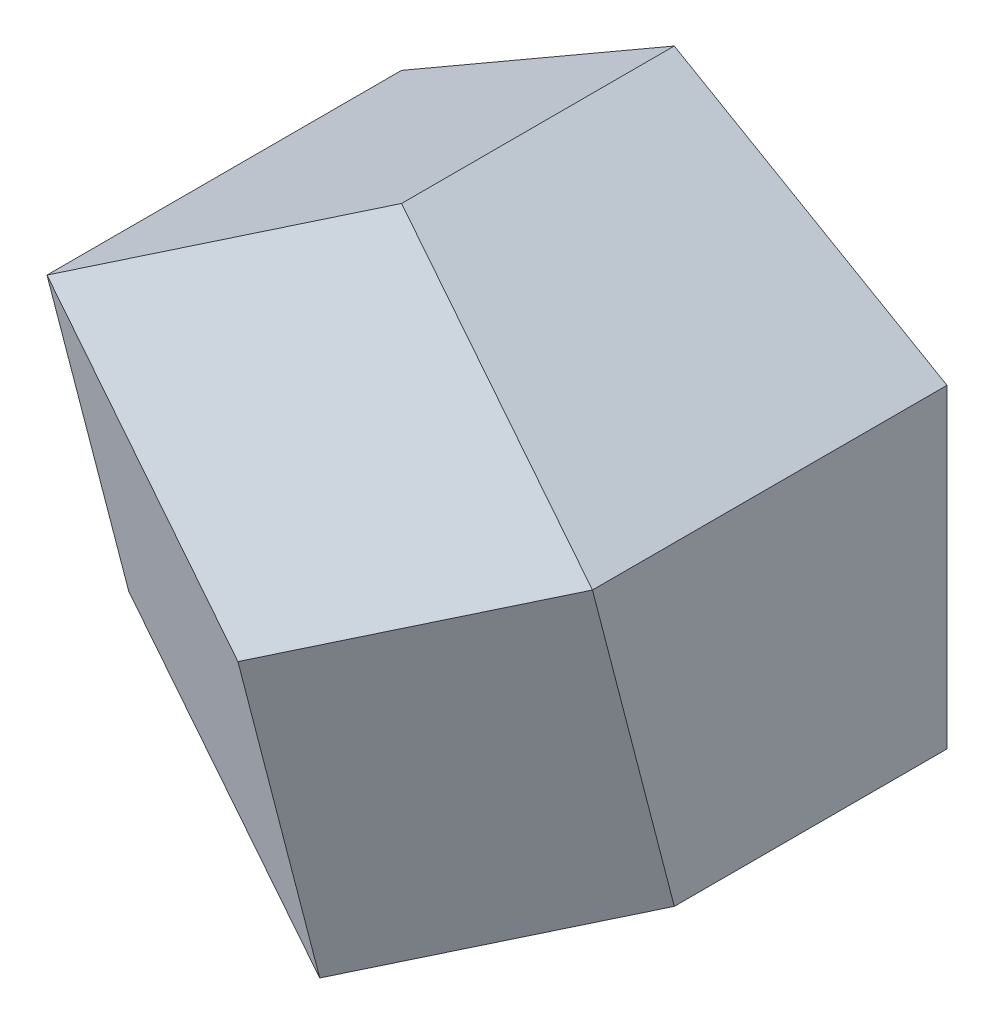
ISO-10303-21;
HEADER;
FILE_DESCRIPTION(('STEP AP214'),'2;1');
FILE_NAME('part.step','',(''),(''),'','','');
FILE_SCHEMA(('AUTOMOTIVE_DESIGN { 1 0 10303 214 1 1 1 1 }'));
ENDSEC;
DATA;
#1=APPLICATION_CONTEXT('core data for automotive mechanical design processes');
#2=APPLICATION_PROTOCOL_DEFINITION('international standard','automotive_design',2000,#1);
#3=PRODUCT_CONTEXT('',#1,'mechanical');
#4=PRODUCT('Part','Part','',(#3));
#5=PRODUCT_RELATED_PRODUCT_CATEGORY('part','',(#4));
#6=PRODUCT_DEFINITION_FORMATION('','',#4);
#7=PRODUCT_DEFINITION_CONTEXT('part definition',#1,'design');
#8=PRODUCT_DEFINITION('design','',#6,#7);
#9=PRODUCT_DEFINITION_SHAPE('','',#8);
#10=(LENGTH_UNIT() NAMED_UNIT(*) SI_UNIT(.MILLI.,.METRE.));
#11=(NAMED_UNIT(*) PLANE_ANGLE_UNIT() SI_UNIT($,.RADIAN.));
#12=(NAMED_UNIT(*) SI_UNIT($,.STERADIAN.) SOLID_ANGLE_UNIT());
#13=UNCERTAINTY_MEASURE_WITH_UNIT(LENGTH_MEASURE(1.E-05),#10,'distance_accuracy_value','');
#14=(GEOMETRIC_REPRESENTATION_CONTEXT(3) GLOBAL_UNCERTAINTY_ASSIGNED_CONTEXT((#13)) GLOBAL_UNIT_ASSIGNED_CONTEXT((#10,
#11,#12)) REPRESENTATION_CONTEXT('',''));
#15=CARTESIAN_POINT('',(0.,0.,0.));
#16=DIRECTION('',(0.,0.,1.));
#17=DIRECTION('',(1.,0.,0.));
#18=AXIS2_PLACEMENT_3D('',#15,#16,#17);
#19=CARTESIAN_POINT('',(50.,28.8675134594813,-50.));
#20=DIRECTION('',(0.5,0.866025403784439,0.));
#21=DIRECTION('',(-0.866025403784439,0.5,0.));
#22=AXIS2_PLACEMENT_3D('',#19,#20,#21);
#23=PLANE('',#22);
#24=DIRECTION('',(-0.838198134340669,0.483933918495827,-0.251459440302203));
#25=VECTOR('',#24,1.);
#26=CARTESIAN_POINT('',(36.2997658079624,36.7773473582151,10.8899297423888));
#27=LINE('',#26,#25);
#28=CARTESIAN_POINT('',(50.,28.8675134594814,15.0000000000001));
#29=VERTEX_POINT('',#28);
#30=CARTESIAN_POINT('',(0.,57.7350269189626,0.));
#31=VERTEX_POINT('',#30);
#32=EDGE_CURVE('E109',#29,#31,#27,.T.);
#33=ORIENTED_EDGE('',*,*,#32,.F.);
#34=DIRECTION('',(0.,0.,1.));
#35=VECTOR('',#34,1.);
#36=CARTESIAN_POINT('',(50.,28.8675134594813,-50.));
#37=LINE('',#36,#35);
#38=CARTESIAN_POINT('',(50.,28.8675134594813,-50.));
#39=VERTEX_POINT('',#38);
#40=EDGE_CURVE('E125',#39,#29,#37,.T.);
#41=ORIENTED_EDGE('',*,*,#40,.F.);
#42=DIRECTION('',(-0.866025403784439,0.5,0.));
#43=VECTOR('',#42,1.);
#44=CARTESIAN_POINT('',(50.,28.8675134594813,-50.));
#45=LINE('',#44,#43);
#46=CARTESIAN_POINT('',(0.,57.7350269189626,-50.));
#47=VERTEX_POINT('',#46);
#48=EDGE_CURVE('E155',#39,#47,#45,.T.);
#49=ORIENTED_EDGE('',*,*,#48,.T.);
#50=DIRECTION('',(0.,0.,1.));
#51=VECTOR('',#50,1.);
#52=CARTESIAN_POINT('',(0.,57.7350269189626,-50.));
#53=LINE('',#52,#51);
#54=EDGE_CURVE('E118',#47,#31,#53,.T.);
#55=ORIENTED_EDGE('',*,*,#54,.T.);
#56=EDGE_LOOP('',(#33,#41,#49,#55));
#57=FACE_BOUND('',#56,.T.);
#58=ADVANCED_FACE('F36',(#57),#23,.T.);
#59=CARTESIAN_POINT('',(50.,-28.8675134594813,-50.));
#60=DIRECTION('',(1.,0.,0.));
#61=DIRECTION('',(0.,1.,0.));
#62=AXIS2_PLACEMENT_3D('',#59,#60,#61);
#63=PLANE('',#62);
#64=DIRECTION('',(0.,0.967867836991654,0.251459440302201));
#65=VECTOR('',#64,1.);
#66=CARTESIAN_POINT('',(50.,-41.0364886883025,-3.1615925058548));
#67=LINE('',#66,#65);
#68=CARTESIAN_POINT('',(50.,-28.8675134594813,0.));
#69=VERTEX_POINT('',#68);
#70=EDGE_CURVE('E57',#69,#29,#67,.T.);
#71=ORIENTED_EDGE('',*,*,#70,.F.);
#72=DIRECTION('',(0.,0.,1.));
#73=VECTOR('',#72,1.);
#74=CARTESIAN_POINT('',(50.,-28.8675134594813,-50.));
#75=LINE('',#74,#73);
#76=CARTESIAN_POINT('',(50.,-28.8675134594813,-50.));
#77=VERTEX_POINT('',#76);
#78=EDGE_CURVE('E127',#77,#69,#75,.T.);
#79=ORIENTED_EDGE('',*,*,#78,.F.);
#80=DIRECTION('',(0.,1.,0.));
#81=VECTOR('',#80,1.);
#82=CARTESIAN_POINT('',(50.,-28.8675134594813,-50.));
#83=LINE('',#82,#81);
#84=EDGE_CURVE('E122',#77,#39,#83,.T.);
#85=ORIENTED_EDGE('',*,*,#84,.T.);
#86=ORIENTED_EDGE('',*,*,#40,.T.);
#87=EDGE_LOOP('',(#71,#79,#85,#86));
#88=FACE_BOUND('',#87,.T.);
#89=ADVANCED_FACE('F172',(#88),#63,.T.);
#90=CARTESIAN_POINT('',(0.,-57.7350269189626,-50.));
#91=DIRECTION('',(0.5,-0.866025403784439,0.));
#92=DIRECTION('',(0.866025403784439,0.5,0.));
#93=AXIS2_PLACEMENT_3D('',#90,#91,#92);
#94=PLANE('',#93);
#95=DIRECTION('',(0.838198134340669,0.483933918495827,-0.251459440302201));
#96=VECTOR('',#95,1.);
#97=CARTESIAN_POINT('',(13.7002341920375,-49.8251930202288,10.8899297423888));
#98=LINE('',#97,#96);
#99=CARTESIAN_POINT('',(2.6602527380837E-13,-57.7350269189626,14.9999999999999));
#100=VERTEX_POINT('',#99);
#101=EDGE_CURVE('E112',#100,#69,#98,.T.);
#102=ORIENTED_EDGE('',*,*,#101,.F.);
#103=DIRECTION('',(0.,0.,1.));
#104=VECTOR('',#103,1.);
#105=CARTESIAN_POINT('',(0.,-57.7350269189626,-50.));
#106=LINE('',#105,#104);
#107=CARTESIAN_POINT('',(0.,-57.7350269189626,-50.));
#108=VERTEX_POINT('',#107);
#109=EDGE_CURVE('E120',#108,#100,#106,.T.);
#110=ORIENTED_EDGE('',*,*,#109,.F.);
#111=DIRECTION('',(0.866025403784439,0.5,0.));
#112=VECTOR('',#111,1.);
#113=CARTESIAN_POINT('',(0.,-57.7350269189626,-50.));
#114=LINE('',#113,#112);
#115=EDGE_CURVE('E144',#108,#77,#114,.T.);
#116=ORIENTED_EDGE('',*,*,#115,.T.);
#117=ORIENTED_EDGE('',*,*,#78,.T.);
#118=EDGE_LOOP('',(#102,#110,#116,#117));
#119=FACE_BOUND('',#118,.T.);
#120=ADVANCED_FACE('F143',(#119),#94,.T.);
#121=CARTESIAN_POINT('',(-50.,-28.8675134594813,-50.));
#122=DIRECTION('',(-0.5,-0.866025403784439,0.));
#123=DIRECTION('',(0.866025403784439,-0.5,0.));
#124=AXIS2_PLACEMENT_3D('',#121,#122,#123);
#125=PLANE('',#124);
#126=DIRECTION('',(0.83819813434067,-0.483933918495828,0.251459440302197));
#127=VECTOR('',#126,1.);
#128=CARTESIAN_POINT('',(-60.5386416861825,-22.7830258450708,-3.16159250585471));
#129=LINE('',#128,#127);
#130=CARTESIAN_POINT('',(-50.,-28.8675134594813,0.));
#131=VERTEX_POINT('',#130);
#132=EDGE_CURVE('E103',#131,#100,#129,.T.);
#133=ORIENTED_EDGE('',*,*,#132,.F.);
#134=DIRECTION('',(0.,0.,1.));
#135=VECTOR('',#134,1.);
#136=CARTESIAN_POINT('',(-50.,-28.8675134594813,-50.));
#137=LINE('',#136,#135);
#138=CARTESIAN_POINT('',(-50.,-28.8675134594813,-50.));
#139=VERTEX_POINT('',#138);
#140=EDGE_CURVE('E102',#139,#131,#137,.T.);
#141=ORIENTED_EDGE('',*,*,#140,.F.);
#142=DIRECTION('',(0.866025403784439,-0.5,0.));
#143=VECTOR('',#142,1.);
#144=CARTESIAN_POINT('',(-50.,-28.8675134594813,-50.));
#145=LINE('',#144,#143);
#146=EDGE_CURVE('E138',#139,#108,#145,.T.);
#147=ORIENTED_EDGE('',*,*,#146,.T.);
#148=ORIENTED_EDGE('',*,*,#109,.T.);
#149=EDGE_LOOP('',(#133,#141,#147,#148));
#150=FACE_BOUND('',#149,.T.);
#151=ADVANCED_FACE('F136',(#150),#125,.T.);
#152=CARTESIAN_POINT('',(-50.,28.8675134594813,-50.));
#153=DIRECTION('',(-1.,0.,0.));
#154=DIRECTION('',(0.,-1.,0.));
#155=AXIS2_PLACEMENT_3D('',#152,#153,#154);
#156=PLANE('',#155);
#157=DIRECTION('',(0.,-0.967867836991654,-0.251459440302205));
#158=VECTOR('',#157,1.);
#159=CARTESIAN_POINT('',(-50.,13.0478456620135,10.8899297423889));
#160=LINE('',#159,#158);
#161=CARTESIAN_POINT('',(-50.,28.8675134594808,15.0000000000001));
#162=VERTEX_POINT('',#161);
#163=EDGE_CURVE('E90',#162,#131,#160,.T.);
#164=ORIENTED_EDGE('',*,*,#163,.F.);
#165=DIRECTION('',(0.,0.,1.));
#166=VECTOR('',#165,1.);
#167=CARTESIAN_POINT('',(-50.,28.8675134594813,-50.));
#168=LINE('',#167,#166);
#169=CARTESIAN_POINT('',(-50.,28.8675134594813,-50.));
#170=VERTEX_POINT('',#169);
#171=EDGE_CURVE('E100',#170,#162,#168,.T.);
#172=ORIENTED_EDGE('',*,*,#171,.F.);
#173=DIRECTION('',(0.,-1.,0.));
#174=VECTOR('',#173,1.);
#175=CARTESIAN_POINT('',(-50.,28.8675134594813,-50.));
#176=LINE('',#175,#174);
#177=EDGE_CURVE('E150',#170,#139,#176,.T.);
#178=ORIENTED_EDGE('',*,*,#177,.T.);
#179=ORIENTED_EDGE('',*,*,#140,.T.);
#180=EDGE_LOOP('',(#164,#172,#178,#179));
#181=FACE_BOUND('',#180,.T.);
#182=ADVANCED_FACE('F97',(#181),#156,.T.);
#183=CARTESIAN_POINT('',(0.,57.7350269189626,-50.));
#184=DIRECTION('',(-0.5,0.866025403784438,0.));
#185=DIRECTION('',(-0.866025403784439,-0.5,0.));
#186=AXIS2_PLACEMENT_3D('',#183,#184,#185);
#187=PLANE('',#186);
#188=DIRECTION('',(-0.838198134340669,-0.483933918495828,0.251459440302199));
#189=VECTOR('',#188,1.);
#190=CARTESIAN_POINT('',(10.5386416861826,63.8195145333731,-3.16159250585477));
#191=LINE('',#190,#189);
#192=EDGE_CURVE('E106',#31,#162,#191,.T.);
#193=ORIENTED_EDGE('',*,*,#192,.F.);
#194=ORIENTED_EDGE('',*,*,#54,.F.);
#195=DIRECTION('',(-0.866025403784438,-0.5,0.));
#196=VECTOR('',#195,1.);
#197=CARTESIAN_POINT('',(0.,57.7350269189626,-50.));
#198=LINE('',#197,#196);
#199=EDGE_CURVE('E117',#47,#170,#198,.T.);
#200=ORIENTED_EDGE('',*,*,#199,.T.);
#201=ORIENTED_EDGE('',*,*,#171,.T.);
#202=EDGE_LOOP('',(#193,#194,#200,#201));
#203=FACE_BOUND('',#202,.T.);
#204=ADVANCED_FACE('F115',(#203),#187,.T.);
#205=CARTESIAN_POINT('',(-50.,86.6025403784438,-50.));
#206=DIRECTION('',(0.,0.,1.));
#207=DIRECTION('',(1.,0.,0.));
#208=AXIS2_PLACEMENT_3D('',#205,#206,#207);
#209=PLANE('',#208);
#210=ORIENTED_EDGE('',*,*,#48,.F.);
#211=ORIENTED_EDGE('',*,*,#84,.F.);
#212=ORIENTED_EDGE('',*,*,#115,.F.);
#213=ORIENTED_EDGE('',*,*,#146,.F.);
#214=ORIENTED_EDGE('',*,*,#177,.F.);
#215=ORIENTED_EDGE('',*,*,#199,.F.);
#216=EDGE_LOOP('',(#210,#211,#212,#213,#214,#215));
#217=FACE_BOUND('',#216,.T.);
#218=ADVANCED_FACE('F149',(#217),#209,.F.);
#219=CARTESIAN_POINT('',(10.6299212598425,-6.13718790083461,23.6220472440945));
#220=DIRECTION('',(-0.399310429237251,0.230541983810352,-0.887356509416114));
#221=DIRECTION('',(-0.911921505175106,0.,0.410364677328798));
#222=AXIS2_PLACEMENT_3D('',#219,#220,#221);
#223=PLANE('',#222);
#224=DIRECTION('',(-0.838198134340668,-0.483933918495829,0.2514594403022));
#225=VECTOR('',#224,1.);
#226=CARTESIAN_POINT('',(6.32318501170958,3.65069256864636,28.1030444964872));
#227=LINE('',#226,#225);
#228=CARTESIAN_POINT('',(0.,0.,30.));
#229=VERTEX_POINT('',#228);
#230=EDGE_CURVE('E43',#29,#229,#227,.T.);
#231=ORIENTED_EDGE('',*,*,#230,.T.);
#232=DIRECTION('',(0.,-0.967867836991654,-0.251459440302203));
#233=VECTOR('',#232,1.);
#234=CARTESIAN_POINT('',(0.,-7.30138513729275,28.1030444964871));
#235=LINE('',#234,#233);
#236=EDGE_CURVE('E50',#229,#100,#235,.T.);
#237=ORIENTED_EDGE('',*,*,#236,.T.);
#238=ORIENTED_EDGE('',*,*,#101,.T.);
#239=ORIENTED_EDGE('',*,*,#70,.T.);
#240=EDGE_LOOP('',(#231,#237,#238,#239));
#241=FACE_BOUND('',#240,.T.);
#242=ADVANCED_FACE('F162',(#241),#223,.F.);
#243=CARTESIAN_POINT('',(0.,12.2743758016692,23.6220472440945));
#244=DIRECTION('',(0.,-0.461083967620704,-0.887356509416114));
#245=DIRECTION('',(0.455960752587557,-0.789747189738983,0.410364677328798));
#246=AXIS2_PLACEMENT_3D('',#243,#244,#245);
#247=PLANE('',#246);
#248=ORIENTED_EDGE('',*,*,#192,.T.);
#249=DIRECTION('',(0.838198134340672,-0.483933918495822,0.2514594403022));
#250=VECTOR('',#249,1.);
#251=CARTESIAN_POINT('',(-6.32318501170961,3.6506925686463,28.1030444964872));
#252=LINE('',#251,#250);
#253=EDGE_CURVE('E12',#162,#229,#252,.T.);
#254=ORIENTED_EDGE('',*,*,#253,.T.);
#255=ORIENTED_EDGE('',*,*,#230,.F.);
#256=ORIENTED_EDGE('',*,*,#32,.T.);
#257=EDGE_LOOP('',(#248,#254,#255,#256));
#258=FACE_BOUND('',#257,.T.);
#259=ADVANCED_FACE('F107',(#258),#247,.F.);
#260=CARTESIAN_POINT('',(-10.6299212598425,-6.13718790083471,23.6220472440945));
#261=DIRECTION('',(0.399310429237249,0.230541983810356,-0.887356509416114));
#262=DIRECTION('',(0.455960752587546,0.789747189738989,0.410364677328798));
#263=AXIS2_PLACEMENT_3D('',#260,#261,#262);
#264=PLANE('',#263);
#265=ORIENTED_EDGE('',*,*,#163,.T.);
#266=ORIENTED_EDGE('',*,*,#132,.T.);
#267=ORIENTED_EDGE('',*,*,#236,.F.);
#268=ORIENTED_EDGE('',*,*,#253,.F.);
#269=EDGE_LOOP('',(#265,#266,#267,#268));
#270=FACE_BOUND('',#269,.T.);
#271=ADVANCED_FACE('F89',(#270),#264,.F.);
#272=CLOSED_SHELL('',(#58,#89,#120,#151,#182,#204,#218,#242,#259,#271));
#273=MANIFOLD_SOLID_BREP('B2',#272);
#274=ADVANCED_BREP_SHAPE_REPRESENTATION('',(#18,#273),#14);
#275=SHAPE_DEFINITION_REPRESENTATION(#9,#274);
ENDSEC;
END-ISO-10303-21;
